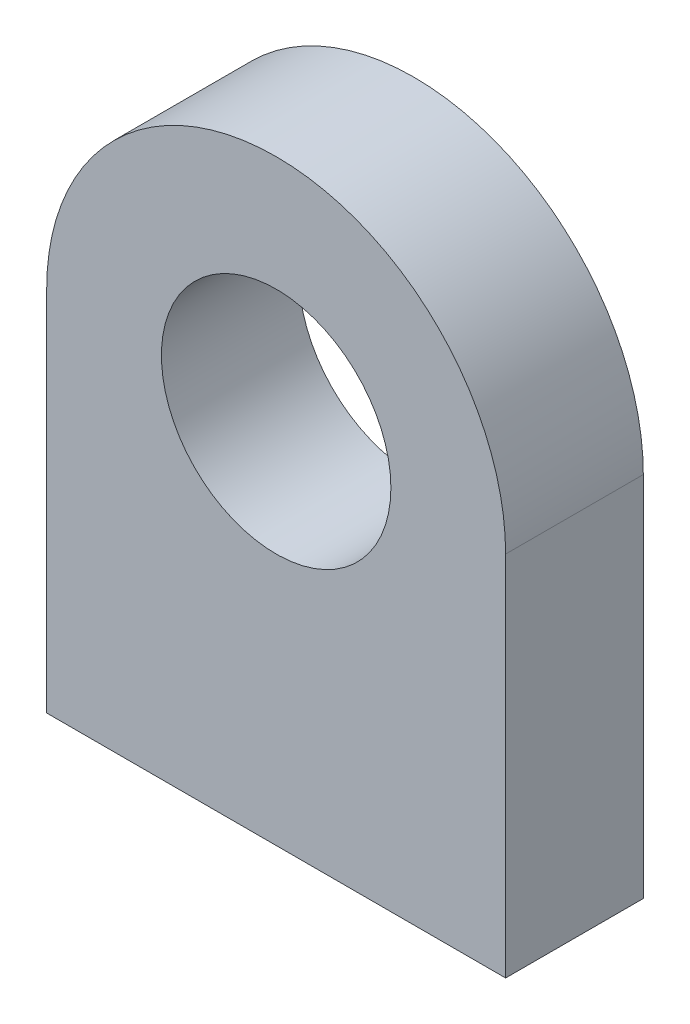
from build123d import *

# Parameters (mm, degrees)
SKETCH1_R      = 25
EXTRUDE1_DEPTH = 30


with BuildPart() as part:
    # Sketch1 → Extrude1 (new body)
    with BuildSketch(Plane.XY):
        with BuildLine():
            Line((-50, 0), (-50, -80))
            Line((-50, -80), (50, -80))
            Line((50, -80), (50, 0))
            ThreePointArc((50, 0), (0, 50), (-50, 0))
        make_face()
        Circle(SKETCH1_R, mode=Mode.SUBTRACT)
    extrude(amount=EXTRUDE1_DEPTH)


solid = part.part
